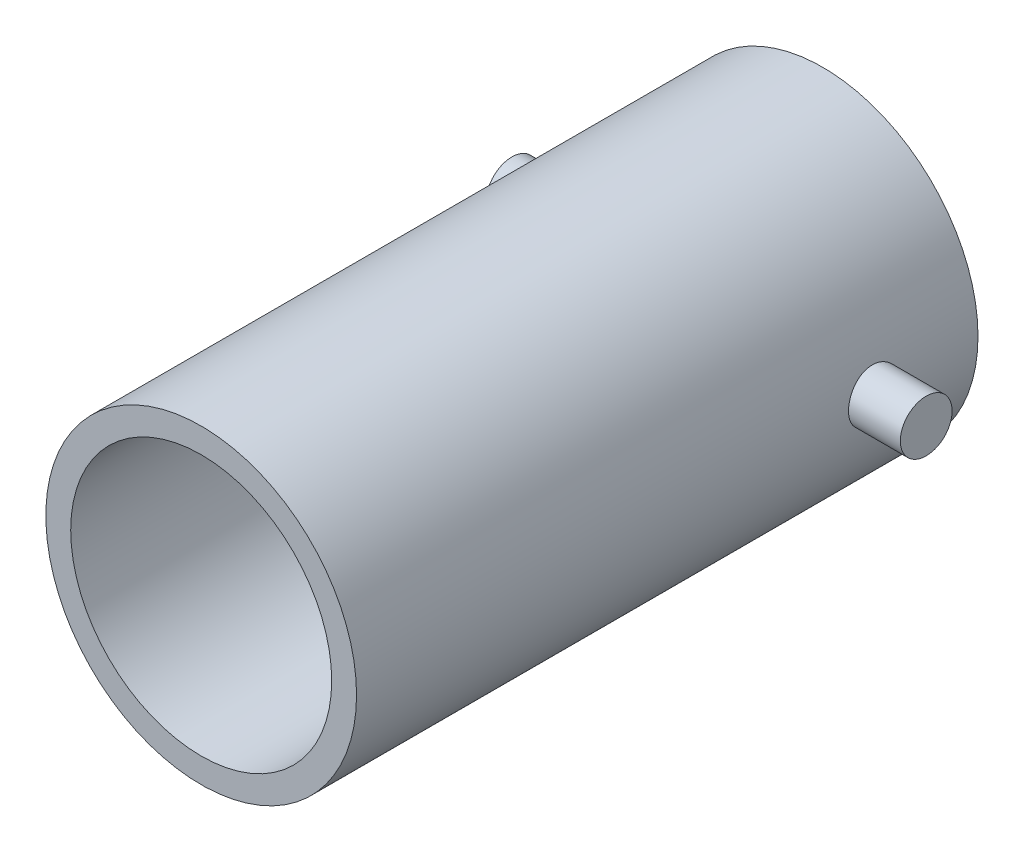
from build123d import *

# Parameters (mm, degrees)
SKETCH1_R               = 28.575
EXTRUDE1_DEPTH          = 44.45
SKETCH2_R               = 4.7625
EXTRUDE2_DEPTH          = 12.7
SKETCH3_R               = 4.7625
EXTRUDE3_DEPTH          = 6.35
EXTRUDE4_DEPTH          = 6.35
EXTRUDE4_DEPTH_BACK     = 6.35
SKETCH4_R               = 0.79375
SKETCH5_R               = 4.0005
CUT_EXTRUDE1_DEPTH      = 19.05
CUT_EXTRUDE2_DEPTH      = 76.268261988
CUT_EXTRUDE2_DEPTH_BACK = 76.268261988


with BuildPart() as part:
    # Sketch1 → Extrude1 (new body)
    with BuildSketch(Plane.XY):
        Circle(SKETCH1_R)
    extrude(amount=-EXTRUDE1_DEPTH)

    # Sketch2 → Extrude2 (add)
    with BuildSketch(Plane(origin=(0, 0, -44.45), x_dir=(-1, 0, 0), z_dir=(0, 0, -1))):
        with Locations(Location((0, 15.0876, 0), (0, 0, 180))):
            Circle(SKETCH2_R)
        with Locations(Location((0, -15.0876, 0), (0, 0, 180))):
            Circle(SKETCH2_R)
    extrude(amount=EXTRUDE2_DEPTH)

    # Sketch3 → Extrude3 (add)
    with BuildSketch(Plane(origin=(0, 0, -57.15), x_dir=(-1, 0, 0), z_dir=(0, 0, -1))):
        with Locations(Location((0, 15.0876, 0), (0, 0, 180))):
            Circle(SKETCH3_R)
    extrude(amount=EXTRUDE3_DEPTH)

    # Sketch4 → Extrude4 (add, two sides: drawn at the far end of the back side and taken through both)
    with BuildSketch(Plane(origin=(0, 0, 0), x_dir=(0, 0, -1), z_dir=(1, 0, 0)).offset(-EXTRUDE4_DEPTH_BACK)):
        with Locations(Location((60.325, 15.0876, 0), (0, 0, 180))):
            Circle(SKETCH4_R)
        with Locations(Location((53.975, -15.0876, 0), (0, 0, 180))):
            Circle(SKETCH4_R)
    extrude(amount=EXTRUDE4_DEPTH + EXTRUDE4_DEPTH_BACK)

    # Sketch5 → Cut-Extrude1 (cut)
    with BuildSketch(Plane(origin=(0, 0, -63.5), x_dir=(-1, 0, 0), z_dir=(0, 0, -1))):
        with Locations((0, 15.0876)):
            Circle(SKETCH5_R)
        with Locations((0, -15.0876)):
            Circle(SKETCH5_R)
    extrude(amount=-CUT_EXTRUDE1_DEPTH, mode=Mode.SUBTRACT)

    # Sketch6 → Cut-Extrude2 (cut, two sides: drawn at the far end of the back side and taken through both)
    with BuildSketch(Plane(origin=(0, 0, 0), x_dir=(1, 0, 0), z_dir=(0, 1, 0)).offset(-CUT_EXTRUDE2_DEPTH_BACK)):
        Polygon((-191.506350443, 44.45), (-30.786598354, 44.45), (32.279814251, 44.45), (192.999566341, 44.45), (192.999566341, -276.98950418), (-191.506350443, -276.98950418), align=None)
    extrude(amount=CUT_EXTRUDE2_DEPTH + CUT_EXTRUDE2_DEPTH_BACK, mode=Mode.SUBTRACT)


with BuildPart() as body_2:
    # of the pieces the cut leaves, the one that is kept (cut_extrude2_keep)
    add(part.part.solids().sort_by_distance((4.7625, 15.0876, -59.53125))[0])


solid = body_2.part
